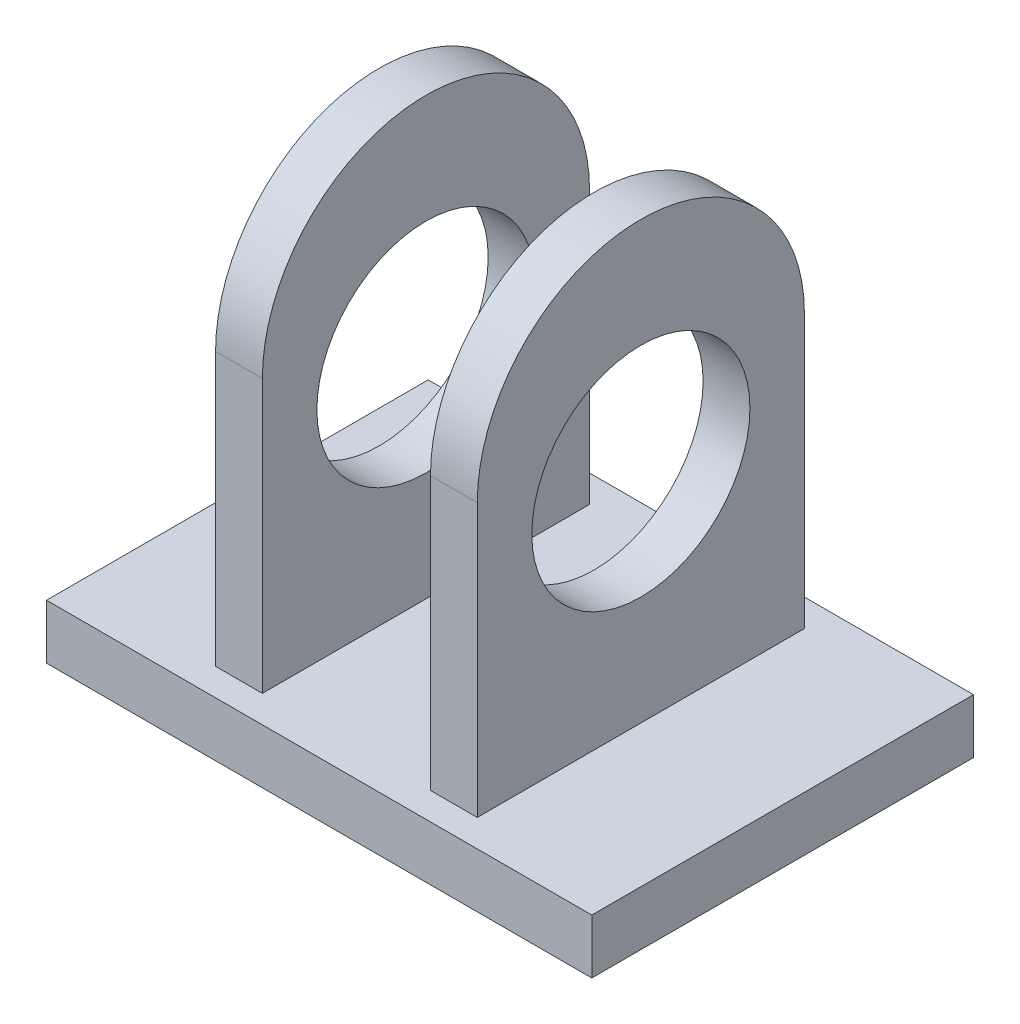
from build123d import *

# Parameters (mm, degrees)
SKETCH1_R           = 11.5
BOSS_EXTRUDE1_DEPTH = 5
SKETCH2_R           = 10.5
CUT_EXTRUDE1_DEPTH  = 9
SKETCH4_W           = 50
SKETCH4_H           = 35
BOSS_EXTRUDE2_DEPTH = 5
SKETCH7_W           = 24
SKETCH7_H           = 30
BOSS_EXTRUDE3_DEPTH = 40
FILLET3_RADIUS      = 15
FILLET3_LENGTH      = 24
SKETCH8_R           = 10
CUT_EXTRUDE2_DEPTH  = 35.5
SKETCH9_W           = 15.416476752
SKETCH9_H           = 65.895727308
CUT_EXTRUDE3_DEPTH  = 35.5


with BuildPart() as part:
    # Sketch1 → Boss-Extrude1 (new body)
    with BuildSketch(Plane(origin=(0, 0, 0), x_dir=(1, 0, 0), z_dir=(0, 1, 0))):
        with Locations(Location((0, 0, 0), (0, 0, 270))):
            Circle(SKETCH1_R)
    extrude(amount=BOSS_EXTRUDE1_DEPTH)

    # Sketch2 → Cut-Extrude1 (cut)
    with BuildSketch(Plane.XZ):
        with Locations(Location((0, 0, 0), (0, 0, 270))):
            Circle(SKETCH2_R)
    extrude(amount=-CUT_EXTRUDE1_DEPTH, mode=Mode.SUBTRACT)

    # Sketch4 → Boss-Extrude2 (add)
    with BuildSketch(Plane(origin=(0, 5, 0), x_dir=(1, 0, 0), z_dir=(0, 1, 0))):
        Rectangle(SKETCH4_W, SKETCH4_H)
    extrude(amount=BOSS_EXTRUDE2_DEPTH)

    # Sketch7 → Boss-Extrude3 (add)
    with BuildSketch(Plane(origin=(0, 10, 0), x_dir=(1, 0, 0), z_dir=(0, 1, 0))):
        Rectangle(SKETCH7_W, SKETCH7_H)
    extrude(amount=BOSS_EXTRUDE3_DEPTH)

    # Fillet3: full round fillet: the end face becomes a half cylinder, R = half its width
    fillet3_face = Plane((0, 50, 0), x_dir=(-1, 0, 0), z_dir=(0, 1, 0))  # on the end face: x along it, z out of the body
    fillet3_slab = fillet3_face.offset(-FILLET3_RADIUS / 2) * Box(FILLET3_LENGTH, 2 * FILLET3_RADIUS, FILLET3_RADIUS, mode=Mode.PRIVATE)  # the body's end, R deep
    fillet3_round = Plane((0, 35, 0), x_dir=(0, 1, 0), z_dir=(-1, 0, 0)) * Cylinder(FILLET3_RADIUS, FILLET3_LENGTH, mode=Mode.PRIVATE)  # its axis R under the face
    add(fillet3_slab - fillet3_round, mode=Mode.SUBTRACT)

    # Sketch8 → Cut-Extrude2 (cut, symmetric)
    with BuildSketch(Plane.ZY.offset(12)):
        with Locations((0, 30)):
            Circle(SKETCH8_R)
    extrude(amount=CUT_EXTRUDE2_DEPTH, both=True, mode=Mode.SUBTRACT)

    # Sketch9 → Cut-Extrude3 (cut, symmetric)
    with BuildSketch(Plane.XY.offset(15)):
        with Locations((0, 42.947863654)):
            Rectangle(SKETCH9_W, SKETCH9_H)
    extrude(amount=CUT_EXTRUDE3_DEPTH, both=True, mode=Mode.SUBTRACT)


solid = part.part
